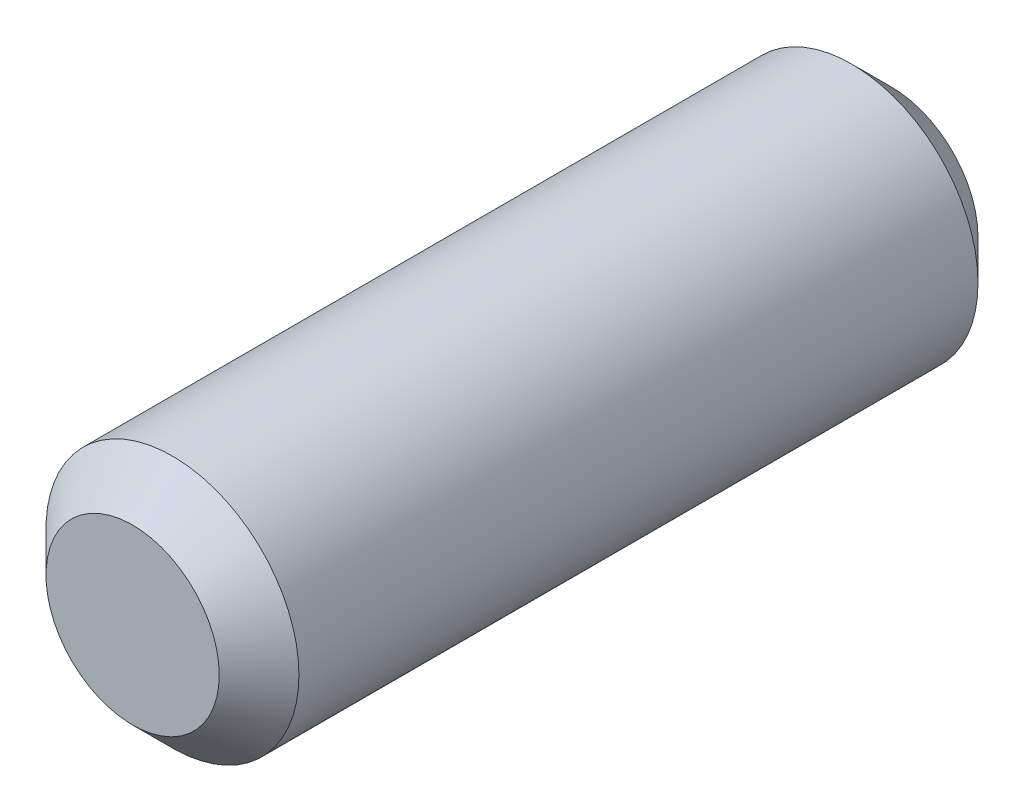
from build123d import *

# Parameters (mm, degrees)
SKETCH_1_R      = 2
EXTRUDE_1_DEPTH = 6
CHAMFER_1_SIZE  = 0.63


with BuildPart() as part:
    # Sketch 1 → Extrude 1 (new, symmetric)
    with BuildSketch(Plane.XY):
        Circle(SKETCH_1_R)
    extrude(amount=EXTRUDE_1_DEPTH, both=True)

    # Chamfer 1
    chamfer_1_edges = [part.edges().sort_by_distance(p)[0] for p in [
        (-2, 0, -6),
        (-2, 0, 6),
    ]]
    chamfer(chamfer_1_edges, length=CHAMFER_1_SIZE)


solid = part.part
